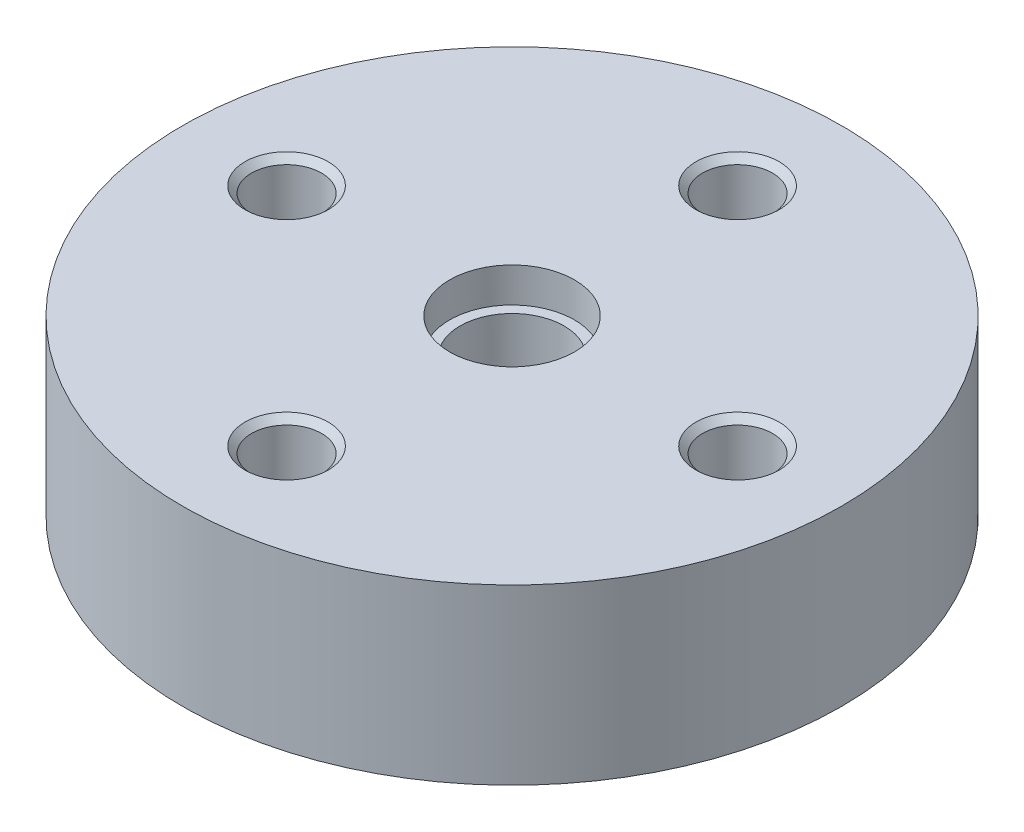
ISO-10303-21;
HEADER;
FILE_DESCRIPTION(('STEP AP214'),'2;1');
FILE_NAME('part.step','',(''),(''),'','','');
FILE_SCHEMA(('AUTOMOTIVE_DESIGN { 1 0 10303 214 1 1 1 1 }'));
ENDSEC;
DATA;
#1=APPLICATION_CONTEXT('core data for automotive mechanical design processes');
#2=APPLICATION_PROTOCOL_DEFINITION('international standard','automotive_design',2000,#1);
#3=PRODUCT_CONTEXT('',#1,'mechanical');
#4=PRODUCT('Part','Part','',(#3));
#5=PRODUCT_RELATED_PRODUCT_CATEGORY('part','',(#4));
#6=PRODUCT_DEFINITION_FORMATION('','',#4);
#7=PRODUCT_DEFINITION_CONTEXT('part definition',#1,'design');
#8=PRODUCT_DEFINITION('design','',#6,#7);
#9=PRODUCT_DEFINITION_SHAPE('','',#8);
#10=(LENGTH_UNIT() NAMED_UNIT(*) SI_UNIT(.MILLI.,.METRE.));
#11=(NAMED_UNIT(*) PLANE_ANGLE_UNIT() SI_UNIT($,.RADIAN.));
#12=(NAMED_UNIT(*) SI_UNIT($,.STERADIAN.) SOLID_ANGLE_UNIT());
#13=UNCERTAINTY_MEASURE_WITH_UNIT(LENGTH_MEASURE(1.E-05),#10,'distance_accuracy_value','');
#14=(GEOMETRIC_REPRESENTATION_CONTEXT(3) GLOBAL_UNCERTAINTY_ASSIGNED_CONTEXT((#13)) GLOBAL_UNIT_ASSIGNED_CONTEXT((#10,
#11,#12)) REPRESENTATION_CONTEXT('',''));
#15=CARTESIAN_POINT('',(0.,0.,0.));
#16=DIRECTION('',(0.,0.,1.));
#17=DIRECTION('',(1.,0.,0.));
#18=AXIS2_PLACEMENT_3D('',#15,#16,#17);
#19=CARTESIAN_POINT('',(0.,12.5,0.));
#20=DIRECTION('',(0.,-1.,0.));
#21=DIRECTION('',(1.,0.,0.));
#22=AXIS2_PLACEMENT_3D('',#19,#20,#21);
#23=CYLINDRICAL_SURFACE('',#22,47.5);
#24=CARTESIAN_POINT('',(0.,0.,0.));
#25=DIRECTION('',(0.,1.,0.));
#26=DIRECTION('',(1.,0.,0.));
#27=AXIS2_PLACEMENT_3D('',#24,#25,#26);
#28=CIRCLE('',#27,47.5);
#29=CARTESIAN_POINT('',(47.5,0.,0.));
#30=VERTEX_POINT('',#29);
#31=EDGE_CURVE('E9',#30,#30,#28,.T.);
#32=ORIENTED_EDGE('',*,*,#31,.T.);
#33=EDGE_LOOP('',(#32));
#34=FACE_BOUND('',#33,.T.);
#35=CARTESIAN_POINT('',(0.,25.,0.));
#36=DIRECTION('',(0.,1.,0.));
#37=DIRECTION('',(1.,0.,0.));
#38=AXIS2_PLACEMENT_3D('',#35,#36,#37);
#39=CIRCLE('',#38,47.5);
#40=CARTESIAN_POINT('',(47.5,25.,0.));
#41=VERTEX_POINT('',#40);
#42=EDGE_CURVE('E175',#41,#41,#39,.T.);
#43=ORIENTED_EDGE('',*,*,#42,.F.);
#44=EDGE_LOOP('',(#43));
#45=FACE_BOUND('',#44,.T.);
#46=ADVANCED_FACE('F15',(#34,#45),#23,.T.);
#47=CARTESIAN_POINT('',(27.5,0.,0.));
#48=DIRECTION('',(0.,-1.,0.));
#49=DIRECTION('',(-1.,0.,0.));
#50=AXIS2_PLACEMENT_3D('',#47,#48,#49);
#51=PLANE('',#50);
#52=CARTESIAN_POINT('',(0.,0.,0.));
#53=DIRECTION('',(0.,1.,0.));
#54=DIRECTION('',(1.,0.,0.));
#55=AXIS2_PLACEMENT_3D('',#52,#53,#54);
#56=CIRCLE('',#55,7.5);
#57=CARTESIAN_POINT('',(7.5,0.,0.));
#58=VERTEX_POINT('',#57);
#59=EDGE_CURVE('E22',#58,#58,#56,.T.);
#60=ORIENTED_EDGE('',*,*,#59,.T.);
#61=EDGE_LOOP('',(#60));
#62=FACE_BOUND('',#61,.T.);
#63=ORIENTED_EDGE('',*,*,#31,.F.);
#64=EDGE_LOOP('',(#63));
#65=FACE_BOUND('',#64,.T.);
#66=ADVANCED_FACE('F182',(#62,#65),#51,.T.);
#67=CARTESIAN_POINT('',(0.,12.5,0.));
#68=DIRECTION('',(0.,-1.,0.));
#69=DIRECTION('',(1.,0.,0.));
#70=AXIS2_PLACEMENT_3D('',#67,#68,#69);
#71=CYLINDRICAL_SURFACE('',#70,7.5);
#72=ORIENTED_EDGE('',*,*,#59,.F.);
#73=EDGE_LOOP('',(#72));
#74=FACE_BOUND('',#73,.T.);
#75=CARTESIAN_POINT('',(0.,20.,0.));
#76=DIRECTION('',(0.,1.,0.));
#77=DIRECTION('',(1.,0.,0.));
#78=AXIS2_PLACEMENT_3D('',#75,#76,#77);
#79=CIRCLE('',#78,7.5);
#80=CARTESIAN_POINT('',(-7.5,20.,0.));
#81=VERTEX_POINT('',#80);
#82=EDGE_CURVE('E173',#81,#81,#79,.T.);
#83=ORIENTED_EDGE('',*,*,#82,.T.);
#84=EDGE_LOOP('',(#83));
#85=FACE_BOUND('',#84,.T.);
#86=ADVANCED_FACE('F187',(#74,#85),#71,.F.);
#87=CARTESIAN_POINT('',(27.5,25.,0.));
#88=DIRECTION('',(0.,1.,0.));
#89=DIRECTION('',(1.,0.,0.));
#90=AXIS2_PLACEMENT_3D('',#87,#88,#89);
#91=PLANE('',#90);
#92=ORIENTED_EDGE('',*,*,#42,.T.);
#93=EDGE_LOOP('',(#92));
#94=FACE_BOUND('',#93,.T.);
#95=CARTESIAN_POINT('',(0.,25.,0.));
#96=DIRECTION('',(0.,-1.,0.));
#97=DIRECTION('',(1.,0.,0.));
#98=AXIS2_PLACEMENT_3D('',#95,#96,#97);
#99=CIRCLE('',#98,9.);
#100=CARTESIAN_POINT('',(-9.,25.,0.));
#101=VERTEX_POINT('',#100);
#102=EDGE_CURVE('E169',#101,#101,#99,.T.);
#103=ORIENTED_EDGE('',*,*,#102,.T.);
#104=EDGE_LOOP('',(#103));
#105=FACE_BOUND('',#104,.T.);
#106=CARTESIAN_POINT('',(32.5,25.,0.));
#107=DIRECTION('',(0.,-1.,0.));
#108=DIRECTION('',(1.,0.,0.));
#109=AXIS2_PLACEMENT_3D('',#106,#107,#108);
#110=CIRCLE('',#109,6.);
#111=CARTESIAN_POINT('',(38.5,25.,0.));
#112=VERTEX_POINT('',#111);
#113=EDGE_CURVE('E159',#112,#112,#110,.T.);
#114=ORIENTED_EDGE('',*,*,#113,.T.);
#115=EDGE_LOOP('',(#114));
#116=FACE_BOUND('',#115,.T.);
#117=CARTESIAN_POINT('',(0.,25.,-32.5));
#118=DIRECTION('',(0.,-1.,0.));
#119=DIRECTION('',(0.,0.,-1.));
#120=AXIS2_PLACEMENT_3D('',#117,#118,#119);
#121=CIRCLE('',#120,6.);
#122=CARTESIAN_POINT('',(0.,25.,-38.5));
#123=VERTEX_POINT('',#122);
#124=EDGE_CURVE('E144',#123,#123,#121,.T.);
#125=ORIENTED_EDGE('',*,*,#124,.T.);
#126=EDGE_LOOP('',(#125));
#127=FACE_BOUND('',#126,.T.);
#128=CARTESIAN_POINT('',(-32.5,25.,0.));
#129=DIRECTION('',(0.,-1.,0.));
#130=DIRECTION('',(-1.,0.,0.));
#131=AXIS2_PLACEMENT_3D('',#128,#129,#130);
#132=CIRCLE('',#131,6.);
#133=CARTESIAN_POINT('',(-38.5,25.,0.));
#134=VERTEX_POINT('',#133);
#135=EDGE_CURVE('E139',#134,#134,#132,.T.);
#136=ORIENTED_EDGE('',*,*,#135,.T.);
#137=EDGE_LOOP('',(#136));
#138=FACE_BOUND('',#137,.T.);
#139=CARTESIAN_POINT('',(0.,25.,32.5));
#140=DIRECTION('',(0.,-1.,0.));
#141=DIRECTION('',(0.,0.,1.));
#142=AXIS2_PLACEMENT_3D('',#139,#140,#141);
#143=CIRCLE('',#142,6.);
#144=CARTESIAN_POINT('',(0.,25.,38.5));
#145=VERTEX_POINT('',#144);
#146=EDGE_CURVE('E490',#145,#145,#143,.T.);
#147=ORIENTED_EDGE('',*,*,#146,.T.);
#148=EDGE_LOOP('',(#147));
#149=FACE_BOUND('',#148,.T.);
#150=ADVANCED_FACE('F178',(#94,#105,#116,#127,#138,#149),#91,.T.);
#151=CARTESIAN_POINT('',(0.,20.,0.));
#152=DIRECTION('',(0.,-1.,0.));
#153=DIRECTION('',(-1.,0.,0.));
#154=AXIS2_PLACEMENT_3D('',#151,#152,#153);
#155=PLANE('',#154);
#156=CARTESIAN_POINT('',(0.,20.,0.));
#157=DIRECTION('',(0.,-1.,0.));
#158=DIRECTION('',(1.,0.,0.));
#159=AXIS2_PLACEMENT_3D('',#156,#157,#158);
#160=CIRCLE('',#159,9.);
#161=CARTESIAN_POINT('',(9.,20.,0.));
#162=VERTEX_POINT('',#161);
#163=EDGE_CURVE('E171',#162,#162,#160,.T.);
#164=ORIENTED_EDGE('',*,*,#163,.F.);
#165=EDGE_LOOP('',(#164));
#166=FACE_BOUND('',#165,.T.);
#167=ORIENTED_EDGE('',*,*,#82,.F.);
#168=EDGE_LOOP('',(#167));
#169=FACE_BOUND('',#168,.T.);
#170=ADVANCED_FACE('F197',(#166,#169),#155,.F.);
#171=CARTESIAN_POINT('',(0.,23.75,0.));
#172=DIRECTION('',(0.,-1.,0.));
#173=DIRECTION('',(1.,0.,0.));
#174=AXIS2_PLACEMENT_3D('',#171,#172,#173);
#175=CYLINDRICAL_SURFACE('',#174,9.);
#176=ORIENTED_EDGE('',*,*,#163,.T.);
#177=EDGE_LOOP('',(#176));
#178=FACE_BOUND('',#177,.T.);
#179=ORIENTED_EDGE('',*,*,#102,.F.);
#180=EDGE_LOOP('',(#179));
#181=FACE_BOUND('',#180,.T.);
#182=ADVANCED_FACE('F200',(#178,#181),#175,.F.);
#183=CARTESIAN_POINT('',(32.5,5.54137867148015,0.));
#184=DIRECTION('',(0.,1.,0.));
#185=DIRECTION('',(1.,0.,0.));
#186=AXIS2_PLACEMENT_3D('',#183,#184,#185);
#187=CONICAL_SURFACE('',#186,2.52640625,1.0471975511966);
#188=CARTESIAN_POINT('',(32.5,7.,0.));
#189=DIRECTION('',(0.,-1.,0.));
#190=DIRECTION('',(1.,0.,0.));
#191=AXIS2_PLACEMENT_3D('',#188,#189,#190);
#192=CIRCLE('',#191,5.0528125);
#193=CARTESIAN_POINT('',(37.5528125,7.,0.));
#194=VERTEX_POINT('',#193);
#195=EDGE_CURVE('E167',#194,#194,#192,.T.);
#196=ORIENTED_EDGE('',*,*,#195,.F.);
#197=EDGE_LOOP('',(#196));
#198=FACE_BOUND('',#197,.T.);
#199=CARTESIAN_POINT('',(32.5,4.08275734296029,0.));
#200=VERTEX_POINT('',#199);
#201=VERTEX_LOOP('',#200);
#202=FACE_BOUND('',#201,.T.);
#203=ADVANCED_FACE('F204',(#198,#202),#187,.F.);
#204=CARTESIAN_POINT('',(32.5,9.52640625,0.));
#205=DIRECTION('',(0.,1.,0.));
#206=DIRECTION('',(1.,0.,0.));
#207=AXIS2_PLACEMENT_3D('',#204,#205,#206);
#208=CYLINDRICAL_SURFACE('',#207,5.0528125);
#209=CARTESIAN_POINT('',(32.5,12.0528125,0.));
#210=DIRECTION('',(0.,-1.,0.));
#211=DIRECTION('',(1.,0.,0.));
#212=AXIS2_PLACEMENT_3D('',#209,#210,#211);
#213=CIRCLE('',#212,5.0528125);
#214=CARTESIAN_POINT('',(37.5528125,12.0528125,0.));
#215=VERTEX_POINT('',#214);
#216=EDGE_CURVE('E165',#215,#215,#213,.T.);
#217=ORIENTED_EDGE('',*,*,#216,.F.);
#218=EDGE_LOOP('',(#217));
#219=FACE_BOUND('',#218,.T.);
#220=ORIENTED_EDGE('',*,*,#195,.T.);
#221=EDGE_LOOP('',(#220));
#222=FACE_BOUND('',#221,.T.);
#223=ADVANCED_FACE('F208',(#219,#222),#208,.F.);
#224=CARTESIAN_POINT('',(32.5,12.52640625,0.));
#225=DIRECTION('',(0.,1.,0.));
#226=DIRECTION('',(1.,0.,0.));
#227=AXIS2_PLACEMENT_3D('',#224,#225,#226);
#228=CONICAL_SURFACE('',#227,5.52640625,0.785398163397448);
#229=CARTESIAN_POINT('',(32.5,13.,0.));
#230=DIRECTION('',(0.,-1.,0.));
#231=DIRECTION('',(1.,0.,0.));
#232=AXIS2_PLACEMENT_3D('',#229,#230,#231);
#233=CIRCLE('',#232,6.);
#234=CARTESIAN_POINT('',(38.5,13.,0.));
#235=VERTEX_POINT('',#234);
#236=EDGE_CURVE('E163',#235,#235,#233,.T.);
#237=ORIENTED_EDGE('',*,*,#236,.F.);
#238=EDGE_LOOP('',(#237));
#239=FACE_BOUND('',#238,.T.);
#240=ORIENTED_EDGE('',*,*,#216,.T.);
#241=EDGE_LOOP('',(#240));
#242=FACE_BOUND('',#241,.T.);
#243=ADVANCED_FACE('F212',(#239,#242),#228,.F.);
#244=CARTESIAN_POINT('',(38.02640625,13.,0.));
#245=DIRECTION('',(0.,1.,0.));
#246=DIRECTION('',(-1.,0.,0.));
#247=AXIS2_PLACEMENT_3D('',#244,#245,#246);
#248=PLANE('',#247);
#249=CARTESIAN_POINT('',(32.5,13.,0.));
#250=DIRECTION('',(0.,-1.,0.));
#251=DIRECTION('',(1.,0.,0.));
#252=AXIS2_PLACEMENT_3D('',#249,#250,#251);
#253=CIRCLE('',#252,5.0528125);
#254=CARTESIAN_POINT('',(37.5528125,13.,0.));
#255=VERTEX_POINT('',#254);
#256=EDGE_CURVE('E161',#255,#255,#253,.T.);
#257=ORIENTED_EDGE('',*,*,#256,.F.);
#258=EDGE_LOOP('',(#257));
#259=FACE_BOUND('',#258,.T.);
#260=ORIENTED_EDGE('',*,*,#236,.T.);
#261=EDGE_LOOP('',(#260));
#262=FACE_BOUND('',#261,.T.);
#263=ADVANCED_FACE('F216',(#259,#262),#248,.F.);
#264=CARTESIAN_POINT('',(32.5,18.52640625,0.));
#265=DIRECTION('',(0.,1.,0.));
#266=DIRECTION('',(1.,0.,0.));
#267=AXIS2_PLACEMENT_3D('',#264,#265,#266);
#268=CYLINDRICAL_SURFACE('',#267,5.0528125);
#269=CARTESIAN_POINT('',(32.5,24.0528125,0.));
#270=DIRECTION('',(0.,-1.,0.));
#271=DIRECTION('',(1.,0.,0.));
#272=AXIS2_PLACEMENT_3D('',#269,#270,#271);
#273=CIRCLE('',#272,5.0528125);
#274=CARTESIAN_POINT('',(37.5528125,24.0528125,0.));
#275=VERTEX_POINT('',#274);
#276=EDGE_CURVE('E157',#275,#275,#273,.T.);
#277=ORIENTED_EDGE('',*,*,#276,.F.);
#278=EDGE_LOOP('',(#277));
#279=FACE_BOUND('',#278,.T.);
#280=ORIENTED_EDGE('',*,*,#256,.T.);
#281=EDGE_LOOP('',(#280));
#282=FACE_BOUND('',#281,.T.);
#283=ADVANCED_FACE('F220',(#279,#282),#268,.F.);
#284=CARTESIAN_POINT('',(32.5,24.52640625,0.));
#285=DIRECTION('',(0.,1.,0.));
#286=DIRECTION('',(1.,0.,0.));
#287=AXIS2_PLACEMENT_3D('',#284,#285,#286);
#288=CONICAL_SURFACE('',#287,5.52640625,0.785398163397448);
#289=ORIENTED_EDGE('',*,*,#113,.F.);
#290=EDGE_LOOP('',(#289));
#291=FACE_BOUND('',#290,.T.);
#292=ORIENTED_EDGE('',*,*,#276,.T.);
#293=EDGE_LOOP('',(#292));
#294=FACE_BOUND('',#293,.T.);
#295=ADVANCED_FACE('F224',(#291,#294),#288,.F.);
#296=CARTESIAN_POINT('',(0.,5.54137867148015,-32.5));
#297=DIRECTION('',(0.,1.,0.));
#298=DIRECTION('',(0.,0.,-1.));
#299=AXIS2_PLACEMENT_3D('',#296,#297,#298);
#300=CONICAL_SURFACE('',#299,2.52640625,1.0471975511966);
#301=CARTESIAN_POINT('',(0.,7.,-32.5));
#302=DIRECTION('',(0.,-1.,0.));
#303=DIRECTION('',(0.,0.,-1.));
#304=AXIS2_PLACEMENT_3D('',#301,#302,#303);
#305=CIRCLE('',#304,5.0528125);
#306=CARTESIAN_POINT('',(0.,7.,-37.5528125));
#307=VERTEX_POINT('',#306);
#308=EDGE_CURVE('E155',#307,#307,#305,.T.);
#309=ORIENTED_EDGE('',*,*,#308,.F.);
#310=EDGE_LOOP('',(#309));
#311=FACE_BOUND('',#310,.T.);
#312=CARTESIAN_POINT('',(0.,4.08275734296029,-32.5));
#313=VERTEX_POINT('',#312);
#314=VERTEX_LOOP('',#313);
#315=FACE_BOUND('',#314,.T.);
#316=ADVANCED_FACE('F228',(#311,#315),#300,.F.);
#317=CARTESIAN_POINT('',(0.,9.52640625,-32.5));
#318=DIRECTION('',(0.,1.,0.));
#319=DIRECTION('',(0.,0.,-1.));
#320=AXIS2_PLACEMENT_3D('',#317,#318,#319);
#321=CYLINDRICAL_SURFACE('',#320,5.0528125);
#322=CARTESIAN_POINT('',(0.,12.0528125,-32.5));
#323=DIRECTION('',(0.,-1.,0.));
#324=DIRECTION('',(0.,0.,-1.));
#325=AXIS2_PLACEMENT_3D('',#322,#323,#324);
#326=CIRCLE('',#325,5.0528125);
#327=CARTESIAN_POINT('',(0.,12.0528125,-37.5528125));
#328=VERTEX_POINT('',#327);
#329=EDGE_CURVE('E152',#328,#328,#326,.T.);
#330=ORIENTED_EDGE('',*,*,#329,.F.);
#331=EDGE_LOOP('',(#330));
#332=FACE_BOUND('',#331,.T.);
#333=ORIENTED_EDGE('',*,*,#308,.T.);
#334=EDGE_LOOP('',(#333));
#335=FACE_BOUND('',#334,.T.);
#336=ADVANCED_FACE('F232',(#332,#335),#321,.F.);
#337=CARTESIAN_POINT('',(0.,12.52640625,-32.5));
#338=DIRECTION('',(0.,1.,0.));
#339=DIRECTION('',(0.,0.,-1.));
#340=AXIS2_PLACEMENT_3D('',#337,#338,#339);
#341=CONICAL_SURFACE('',#340,5.52640625,0.785398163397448);
#342=CARTESIAN_POINT('',(0.,13.,-32.5));
#343=DIRECTION('',(0.,-1.,0.));
#344=DIRECTION('',(0.,0.,-1.));
#345=AXIS2_PLACEMENT_3D('',#342,#343,#344);
#346=CIRCLE('',#345,6.);
#347=CARTESIAN_POINT('',(0.,13.,-38.5));
#348=VERTEX_POINT('',#347);
#349=EDGE_CURVE('E150',#348,#348,#346,.T.);
#350=ORIENTED_EDGE('',*,*,#349,.F.);
#351=EDGE_LOOP('',(#350));
#352=FACE_BOUND('',#351,.T.);
#353=ORIENTED_EDGE('',*,*,#329,.T.);
#354=EDGE_LOOP('',(#353));
#355=FACE_BOUND('',#354,.T.);
#356=ADVANCED_FACE('F236',(#352,#355),#341,.F.);
#357=CARTESIAN_POINT('',(0.,13.,-38.02640625));
#358=DIRECTION('',(0.,1.,0.));
#359=DIRECTION('',(0.,0.,1.));
#360=AXIS2_PLACEMENT_3D('',#357,#358,#359);
#361=PLANE('',#360);
#362=CARTESIAN_POINT('',(0.,13.,-32.5));
#363=DIRECTION('',(0.,-1.,0.));
#364=DIRECTION('',(0.,0.,-1.));
#365=AXIS2_PLACEMENT_3D('',#362,#363,#364);
#366=CIRCLE('',#365,5.0528125);
#367=CARTESIAN_POINT('',(0.,13.,-37.5528125));
#368=VERTEX_POINT('',#367);
#369=EDGE_CURVE('E153',#368,#368,#366,.T.);
#370=ORIENTED_EDGE('',*,*,#369,.F.);
#371=EDGE_LOOP('',(#370));
#372=FACE_BOUND('',#371,.T.);
#373=ORIENTED_EDGE('',*,*,#349,.T.);
#374=EDGE_LOOP('',(#373));
#375=FACE_BOUND('',#374,.T.);
#376=ADVANCED_FACE('F238',(#372,#375),#361,.F.);
#377=CARTESIAN_POINT('',(0.,18.52640625,-32.5));
#378=DIRECTION('',(0.,1.,0.));
#379=DIRECTION('',(0.,0.,-1.));
#380=AXIS2_PLACEMENT_3D('',#377,#378,#379);
#381=CYLINDRICAL_SURFACE('',#380,5.0528125);
#382=CARTESIAN_POINT('',(0.,24.0528125,-32.5));
#383=DIRECTION('',(0.,-1.,0.));
#384=DIRECTION('',(0.,0.,-1.));
#385=AXIS2_PLACEMENT_3D('',#382,#383,#384);
#386=CIRCLE('',#385,5.0528125);
#387=CARTESIAN_POINT('',(0.,24.0528125,-37.5528125));
#388=VERTEX_POINT('',#387);
#389=EDGE_CURVE('E142',#388,#388,#386,.T.);
#390=ORIENTED_EDGE('',*,*,#389,.F.);
#391=EDGE_LOOP('',(#390));
#392=FACE_BOUND('',#391,.T.);
#393=ORIENTED_EDGE('',*,*,#369,.T.);
#394=EDGE_LOOP('',(#393));
#395=FACE_BOUND('',#394,.T.);
#396=ADVANCED_FACE('F241',(#392,#395),#381,.F.);
#397=CARTESIAN_POINT('',(0.,24.52640625,-32.5));
#398=DIRECTION('',(0.,1.,0.));
#399=DIRECTION('',(0.,0.,-1.));
#400=AXIS2_PLACEMENT_3D('',#397,#398,#399);
#401=CONICAL_SURFACE('',#400,5.52640625,0.785398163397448);
#402=ORIENTED_EDGE('',*,*,#124,.F.);
#403=EDGE_LOOP('',(#402));
#404=FACE_BOUND('',#403,.T.);
#405=ORIENTED_EDGE('',*,*,#389,.T.);
#406=EDGE_LOOP('',(#405));
#407=FACE_BOUND('',#406,.T.);
#408=ADVANCED_FACE('F245',(#404,#407),#401,.F.);
#409=CARTESIAN_POINT('',(-32.5,5.54137867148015,0.));
#410=DIRECTION('',(0.,1.,0.));
#411=DIRECTION('',(-1.,0.,0.));
#412=AXIS2_PLACEMENT_3D('',#409,#410,#411);
#413=CONICAL_SURFACE('',#412,2.52640625,1.0471975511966);
#414=CARTESIAN_POINT('',(-32.5,7.,0.));
#415=DIRECTION('',(0.,-1.,0.));
#416=DIRECTION('',(-1.,0.,0.));
#417=AXIS2_PLACEMENT_3D('',#414,#415,#416);
#418=CIRCLE('',#417,5.0528125);
#419=CARTESIAN_POINT('',(-37.5528125,7.,0.));
#420=VERTEX_POINT('',#419);
#421=EDGE_CURVE('E145',#420,#420,#418,.T.);
#422=ORIENTED_EDGE('',*,*,#421,.F.);
#423=EDGE_LOOP('',(#422));
#424=FACE_BOUND('',#423,.T.);
#425=CARTESIAN_POINT('',(-32.5,4.08275734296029,0.));
#426=VERTEX_POINT('',#425);
#427=VERTEX_LOOP('',#426);
#428=FACE_BOUND('',#427,.T.);
#429=ADVANCED_FACE('F263',(#424,#428),#413,.F.);
#430=CARTESIAN_POINT('',(-32.5,9.52640625,0.));
#431=DIRECTION('',(0.,1.,0.));
#432=DIRECTION('',(-1.,0.,0.));
#433=AXIS2_PLACEMENT_3D('',#430,#431,#432);
#434=CYLINDRICAL_SURFACE('',#433,5.0528125);
#435=CARTESIAN_POINT('',(-32.5,12.0528125,0.));
#436=DIRECTION('',(0.,-1.,0.));
#437=DIRECTION('',(-1.,0.,0.));
#438=AXIS2_PLACEMENT_3D('',#435,#436,#437);
#439=CIRCLE('',#438,5.0528125);
#440=CARTESIAN_POINT('',(-37.5528125,12.0528125,0.));
#441=VERTEX_POINT('',#440);
#442=EDGE_CURVE('E149',#441,#441,#439,.T.);
#443=ORIENTED_EDGE('',*,*,#442,.F.);
#444=EDGE_LOOP('',(#443));
#445=FACE_BOUND('',#444,.T.);
#446=ORIENTED_EDGE('',*,*,#421,.T.);
#447=EDGE_LOOP('',(#446));
#448=FACE_BOUND('',#447,.T.);
#449=ADVANCED_FACE('F251',(#445,#448),#434,.F.);
#450=CARTESIAN_POINT('',(-32.5,12.52640625,0.));
#451=DIRECTION('',(0.,1.,0.));
#452=DIRECTION('',(-1.,0.,0.));
#453=AXIS2_PLACEMENT_3D('',#450,#451,#452);
#454=CONICAL_SURFACE('',#453,5.52640625,0.785398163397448);
#455=CARTESIAN_POINT('',(-32.5,13.,0.));
#456=DIRECTION('',(0.,-1.,0.));
#457=DIRECTION('',(-1.,0.,0.));
#458=AXIS2_PLACEMENT_3D('',#455,#456,#457);
#459=CIRCLE('',#458,6.);
#460=CARTESIAN_POINT('',(-38.5,13.,0.));
#461=VERTEX_POINT('',#460);
#462=EDGE_CURVE('E147',#461,#461,#459,.T.);
#463=ORIENTED_EDGE('',*,*,#462,.F.);
#464=EDGE_LOOP('',(#463));
#465=FACE_BOUND('',#464,.T.);
#466=ORIENTED_EDGE('',*,*,#442,.T.);
#467=EDGE_LOOP('',(#466));
#468=FACE_BOUND('',#467,.T.);
#469=ADVANCED_FACE('F247',(#465,#468),#454,.F.);
#470=CARTESIAN_POINT('',(-38.02640625,13.,0.));
#471=DIRECTION('',(0.,1.,0.));
#472=DIRECTION('',(1.,0.,0.));
#473=AXIS2_PLACEMENT_3D('',#470,#471,#472);
#474=PLANE('',#473);
#475=CARTESIAN_POINT('',(-32.5,13.,0.));
#476=DIRECTION('',(0.,-1.,0.));
#477=DIRECTION('',(-1.,0.,0.));
#478=AXIS2_PLACEMENT_3D('',#475,#476,#477);
#479=CIRCLE('',#478,5.0528125);
#480=CARTESIAN_POINT('',(-37.5528125,13.,0.));
#481=VERTEX_POINT('',#480);
#482=EDGE_CURVE('E140',#481,#481,#479,.T.);
#483=ORIENTED_EDGE('',*,*,#482,.F.);
#484=EDGE_LOOP('',(#483));
#485=FACE_BOUND('',#484,.T.);
#486=ORIENTED_EDGE('',*,*,#462,.T.);
#487=EDGE_LOOP('',(#486));
#488=FACE_BOUND('',#487,.T.);
#489=ADVANCED_FACE('F250',(#485,#488),#474,.F.);
#490=CARTESIAN_POINT('',(-32.5,18.52640625,0.));
#491=DIRECTION('',(0.,1.,0.));
#492=DIRECTION('',(-1.,0.,0.));
#493=AXIS2_PLACEMENT_3D('',#490,#491,#492);
#494=CYLINDRICAL_SURFACE('',#493,5.0528125);
#495=CARTESIAN_POINT('',(-32.5,24.0528125,0.));
#496=DIRECTION('',(0.,-1.,0.));
#497=DIRECTION('',(-1.,0.,0.));
#498=AXIS2_PLACEMENT_3D('',#495,#496,#497);
#499=CIRCLE('',#498,5.0528125);
#500=CARTESIAN_POINT('',(-37.5528125,24.0528125,0.));
#501=VERTEX_POINT('',#500);
#502=EDGE_CURVE('E133',#501,#501,#499,.T.);
#503=ORIENTED_EDGE('',*,*,#502,.F.);
#504=EDGE_LOOP('',(#503));
#505=FACE_BOUND('',#504,.T.);
#506=ORIENTED_EDGE('',*,*,#482,.T.);
#507=EDGE_LOOP('',(#506));
#508=FACE_BOUND('',#507,.T.);
#509=ADVANCED_FACE('F255',(#505,#508),#494,.F.);
#510=CARTESIAN_POINT('',(-32.5,24.52640625,0.));
#511=DIRECTION('',(0.,1.,0.));
#512=DIRECTION('',(-1.,0.,0.));
#513=AXIS2_PLACEMENT_3D('',#510,#511,#512);
#514=CONICAL_SURFACE('',#513,5.52640625,0.785398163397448);
#515=ORIENTED_EDGE('',*,*,#135,.F.);
#516=EDGE_LOOP('',(#515));
#517=FACE_BOUND('',#516,.T.);
#518=ORIENTED_EDGE('',*,*,#502,.T.);
#519=EDGE_LOOP('',(#518));
#520=FACE_BOUND('',#519,.T.);
#521=ADVANCED_FACE('F259',(#517,#520),#514,.F.);
#522=CARTESIAN_POINT('',(0.,5.54137867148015,32.5));
#523=DIRECTION('',(0.,1.,0.));
#524=DIRECTION('',(0.,0.,1.));
#525=AXIS2_PLACEMENT_3D('',#522,#523,#524);
#526=CONICAL_SURFACE('',#525,2.52640625,1.0471975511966);
#527=CARTESIAN_POINT('',(0.,7.,32.5));
#528=DIRECTION('',(0.,-1.,0.));
#529=DIRECTION('',(0.,0.,1.));
#530=AXIS2_PLACEMENT_3D('',#527,#528,#529);
#531=CIRCLE('',#530,5.0528125);
#532=CARTESIAN_POINT('',(0.,7.,37.5528125));
#533=VERTEX_POINT('',#532);
#534=EDGE_CURVE('E130',#533,#533,#531,.T.);
#535=ORIENTED_EDGE('',*,*,#534,.F.);
#536=EDGE_LOOP('',(#535));
#537=FACE_BOUND('',#536,.T.);
#538=CARTESIAN_POINT('',(0.,4.08275734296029,32.5));
#539=VERTEX_POINT('',#538);
#540=VERTEX_LOOP('',#539);
#541=FACE_BOUND('',#540,.T.);
#542=ADVANCED_FACE('F267',(#537,#541),#526,.F.);
#543=CARTESIAN_POINT('',(0.,9.52640625,32.5));
#544=DIRECTION('',(0.,1.,0.));
#545=DIRECTION('',(0.,0.,1.));
#546=AXIS2_PLACEMENT_3D('',#543,#544,#545);
#547=CYLINDRICAL_SURFACE('',#546,5.0528125);
#548=CARTESIAN_POINT('',(0.,12.0528125,32.5));
#549=DIRECTION('',(0.,-1.,0.));
#550=DIRECTION('',(0.,0.,1.));
#551=AXIS2_PLACEMENT_3D('',#548,#549,#550);
#552=CIRCLE('',#551,5.0528125);
#553=CARTESIAN_POINT('',(0.,12.0528125,37.5528125));
#554=VERTEX_POINT('',#553);
#555=EDGE_CURVE('E127',#554,#554,#552,.T.);
#556=ORIENTED_EDGE('',*,*,#555,.F.);
#557=EDGE_LOOP('',(#556));
#558=FACE_BOUND('',#557,.T.);
#559=ORIENTED_EDGE('',*,*,#534,.T.);
#560=EDGE_LOOP('',(#559));
#561=FACE_BOUND('',#560,.T.);
#562=ADVANCED_FACE('F274',(#558,#561),#547,.F.);
#563=CARTESIAN_POINT('',(0.,12.52640625,32.5));
#564=DIRECTION('',(0.,1.,0.));
#565=DIRECTION('',(0.,0.,1.));
#566=AXIS2_PLACEMENT_3D('',#563,#564,#565);
#567=CONICAL_SURFACE('',#566,5.52640625,0.785398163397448);
#568=CARTESIAN_POINT('',(0.,13.,32.5));
#569=DIRECTION('',(0.,-1.,0.));
#570=DIRECTION('',(0.,0.,1.));
#571=AXIS2_PLACEMENT_3D('',#568,#569,#570);
#572=CIRCLE('',#571,6.);
#573=CARTESIAN_POINT('',(0.,13.,38.5));
#574=VERTEX_POINT('',#573);
#575=EDGE_CURVE('E131',#574,#574,#572,.T.);
#576=ORIENTED_EDGE('',*,*,#575,.F.);
#577=EDGE_LOOP('',(#576));
#578=FACE_BOUND('',#577,.T.);
#579=ORIENTED_EDGE('',*,*,#555,.T.);
#580=EDGE_LOOP('',(#579));
#581=FACE_BOUND('',#580,.T.);
#582=ADVANCED_FACE('F128',(#578,#581),#567,.F.);
#583=CARTESIAN_POINT('',(0.,13.,38.02640625));
#584=DIRECTION('',(0.,1.,0.));
#585=DIRECTION('',(0.,0.,-1.));
#586=AXIS2_PLACEMENT_3D('',#583,#584,#585);
#587=PLANE('',#586);
#588=CARTESIAN_POINT('',(0.,13.,32.5));
#589=DIRECTION('',(0.,-1.,0.));
#590=DIRECTION('',(0.,0.,1.));
#591=AXIS2_PLACEMENT_3D('',#588,#589,#590);
#592=CIRCLE('',#591,5.0528125);
#593=CARTESIAN_POINT('',(0.,13.,37.5528125));
#594=VERTEX_POINT('',#593);
#595=EDGE_CURVE('E135',#594,#594,#592,.T.);
#596=ORIENTED_EDGE('',*,*,#595,.F.);
#597=EDGE_LOOP('',(#596));
#598=FACE_BOUND('',#597,.T.);
#599=ORIENTED_EDGE('',*,*,#575,.T.);
#600=EDGE_LOOP('',(#599));
#601=FACE_BOUND('',#600,.T.);
#602=ADVANCED_FACE('F280',(#598,#601),#587,.F.);
#603=CARTESIAN_POINT('',(0.,18.52640625,32.5));
#604=DIRECTION('',(0.,1.,0.));
#605=DIRECTION('',(0.,0.,1.));
#606=AXIS2_PLACEMENT_3D('',#603,#604,#605);
#607=CYLINDRICAL_SURFACE('',#606,5.0528125);
#608=CARTESIAN_POINT('',(0.,24.0528125,32.5));
#609=DIRECTION('',(0.,-1.,0.));
#610=DIRECTION('',(0.,0.,1.));
#611=AXIS2_PLACEMENT_3D('',#608,#609,#610);
#612=CIRCLE('',#611,5.0528125);
#613=CARTESIAN_POINT('',(0.,24.0528125,37.5528125));
#614=VERTEX_POINT('',#613);
#615=EDGE_CURVE('E492',#614,#614,#612,.T.);
#616=ORIENTED_EDGE('',*,*,#615,.F.);
#617=EDGE_LOOP('',(#616));
#618=FACE_BOUND('',#617,.T.);
#619=ORIENTED_EDGE('',*,*,#595,.T.);
#620=EDGE_LOOP('',(#619));
#621=FACE_BOUND('',#620,.T.);
#622=ADVANCED_FACE('F284',(#618,#621),#607,.F.);
#623=CARTESIAN_POINT('',(0.,24.52640625,32.5));
#624=DIRECTION('',(0.,1.,0.));
#625=DIRECTION('',(0.,0.,1.));
#626=AXIS2_PLACEMENT_3D('',#623,#624,#625);
#627=CONICAL_SURFACE('',#626,5.52640625,0.785398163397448);
#628=ORIENTED_EDGE('',*,*,#146,.F.);
#629=EDGE_LOOP('',(#628));
#630=FACE_BOUND('',#629,.T.);
#631=ORIENTED_EDGE('',*,*,#615,.T.);
#632=EDGE_LOOP('',(#631));
#633=FACE_BOUND('',#632,.T.);
#634=ADVANCED_FACE('F291',(#630,#633),#627,.F.);
#635=CLOSED_SHELL('',(#46,#66,#86,#150,#170,#182,#203,#223,#243,#263,#283,#295,#316,#336,#356,
#376,#396,#408,#429,#449,#469,#489,#509,#521,#542,#562,#582,#602,#622,#634));
#636=MANIFOLD_SOLID_BREP('B1',#635);
#637=ADVANCED_BREP_SHAPE_REPRESENTATION('',(#18,#636),#14);
#638=SHAPE_DEFINITION_REPRESENTATION(#9,#637);
ENDSEC;
END-ISO-10303-21;
